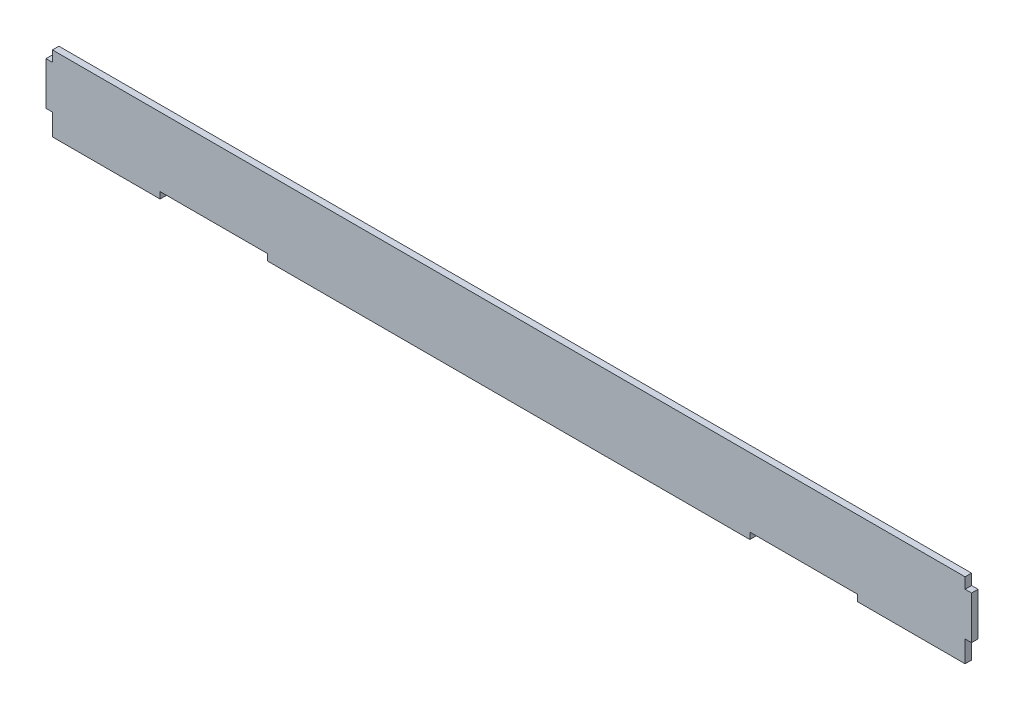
from build123d import *

# Parameters (mm, degrees)
BOSS_EXTRUDE1_DEPTH = 3


with BuildPart() as part:
    # Sketch1 → Boss-Extrude1 (new body)
    with BuildSketch(Plane.XY):
        Polygon((100, 0), (324, 0), (324, 3), (374, 3), (374, 0), (424, 0), (424, 10), (427, 10), (427, 30), (424, 30), (424, 35), (0, 35), (0, 30), (-3, 30), (-3, 10), (0, 10), (0, 0), (50, 0), (50, 3), (100, 3), align=None)
    extrude(amount=BOSS_EXTRUDE1_DEPTH)


solid = part.part
